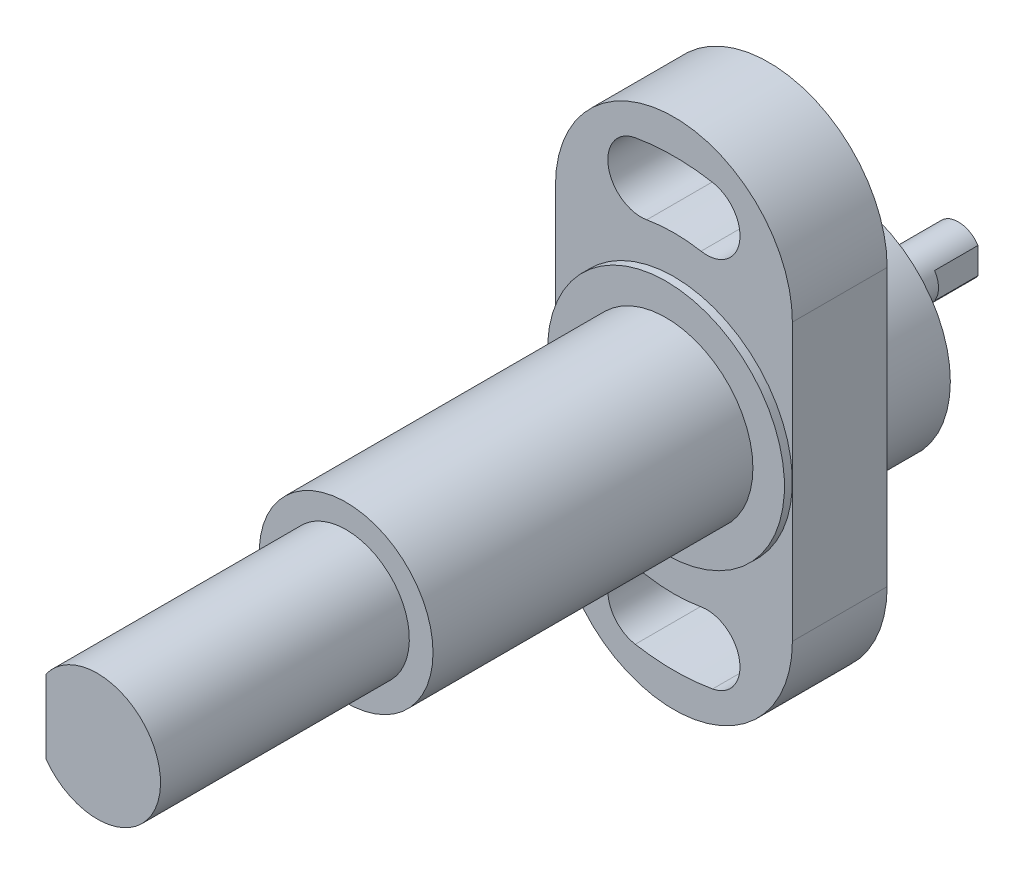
ISO-10303-21;
HEADER;
FILE_DESCRIPTION(('STEP AP214'),'2;1');
FILE_NAME('part.step','',(''),(''),'','','');
FILE_SCHEMA(('AUTOMOTIVE_DESIGN { 1 0 10303 214 1 1 1 1 }'));
ENDSEC;
DATA;
#1=APPLICATION_CONTEXT('core data for automotive mechanical design processes');
#2=APPLICATION_PROTOCOL_DEFINITION('international standard','automotive_design',2000,#1);
#3=PRODUCT_CONTEXT('',#1,'mechanical');
#4=PRODUCT('Part','Part','',(#3));
#5=PRODUCT_RELATED_PRODUCT_CATEGORY('part','',(#4));
#6=PRODUCT_DEFINITION_FORMATION('','',#4);
#7=PRODUCT_DEFINITION_CONTEXT('part definition',#1,'design');
#8=PRODUCT_DEFINITION('design','',#6,#7);
#9=PRODUCT_DEFINITION_SHAPE('','',#8);
#10=(LENGTH_UNIT() NAMED_UNIT(*) SI_UNIT(.MILLI.,.METRE.));
#11=(NAMED_UNIT(*) PLANE_ANGLE_UNIT() SI_UNIT($,.RADIAN.));
#12=(NAMED_UNIT(*) SI_UNIT($,.STERADIAN.) SOLID_ANGLE_UNIT());
#13=UNCERTAINTY_MEASURE_WITH_UNIT(LENGTH_MEASURE(1.E-05),#10,'distance_accuracy_value','');
#14=(GEOMETRIC_REPRESENTATION_CONTEXT(3) GLOBAL_UNCERTAINTY_ASSIGNED_CONTEXT((#13)) GLOBAL_UNIT_ASSIGNED_CONTEXT((#10,
#11,#12)) REPRESENTATION_CONTEXT('',''));
#15=CARTESIAN_POINT('',(0.,0.,0.));
#16=DIRECTION('',(0.,0.,1.));
#17=DIRECTION('',(1.,0.,0.));
#18=AXIS2_PLACEMENT_3D('',#15,#16,#17);
#19=CARTESIAN_POINT('',(-8.,0.,-9.));
#20=DIRECTION('',(0.,0.,-1.));
#21=DIRECTION('',(0.,1.,0.));
#22=AXIS2_PLACEMENT_3D('',#19,#20,#21);
#23=PLANE('',#22);
#24=CARTESIAN_POINT('',(0.,0.,-9.));
#25=DIRECTION('',(0.,0.,1.));
#26=DIRECTION('',(0.,1.,0.));
#27=AXIS2_PLACEMENT_3D('',#24,#25,#26);
#28=CIRCLE('',#27,14.);
#29=CARTESIAN_POINT('',(0.,14.,-9.));
#30=VERTEX_POINT('',#29);
#31=EDGE_CURVE('E291',#30,#30,#28,.T.);
#32=ORIENTED_EDGE('',*,*,#31,.F.);
#33=EDGE_LOOP('',(#32));
#34=FACE_BOUND('',#33,.T.);
#35=CARTESIAN_POINT('',(0.,0.,-9.));
#36=DIRECTION('',(0.,0.,-1.));
#37=DIRECTION('',(-1.,0.,0.));
#38=AXIS2_PLACEMENT_3D('',#35,#36,#37);
#39=CIRCLE('',#38,3.);
#40=CARTESIAN_POINT('',(-3.,0.,-9.));
#41=VERTEX_POINT('',#40);
#42=EDGE_CURVE('E195',#41,#41,#39,.T.);
#43=ORIENTED_EDGE('',*,*,#42,.F.);
#44=EDGE_LOOP('',(#43));
#45=FACE_BOUND('',#44,.T.);
#46=ADVANCED_FACE('F15',(#34,#45),#23,.T.);
#47=CARTESIAN_POINT('',(0.,0.,-9.));
#48=DIRECTION('',(0.,0.,1.));
#49=DIRECTION('',(0.,-1.,0.));
#50=AXIS2_PLACEMENT_3D('',#47,#48,#49);
#51=CYLINDRICAL_SURFACE('',#50,28.2);
#52=DIRECTION('',(0.,0.,1.));
#53=VECTOR('',#52,1.);
#54=CARTESIAN_POINT('',(4.89687861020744,27.7715786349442,-9.));
#55=LINE('',#54,#53);
#56=CARTESIAN_POINT('',(4.89687861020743,27.7715786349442,0.));
#57=VERTEX_POINT('',#56);
#58=CARTESIAN_POINT('',(4.89687861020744,27.7715786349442,12.));
#59=VERTEX_POINT('',#58);
#60=EDGE_CURVE('E287',#57,#59,#55,.T.);
#61=ORIENTED_EDGE('',*,*,#60,.T.);
#62=CARTESIAN_POINT('',(0.,0.,12.));
#63=DIRECTION('',(0.,0.,1.));
#64=DIRECTION('',(0.,1.,0.));
#65=AXIS2_PLACEMENT_3D('',#62,#63,#64);
#66=CIRCLE('',#65,28.2);
#67=CARTESIAN_POINT('',(-4.89687861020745,27.7715786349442,12.));
#68=VERTEX_POINT('',#67);
#69=EDGE_CURVE('E391',#59,#68,#66,.T.);
#70=ORIENTED_EDGE('',*,*,#69,.T.);
#71=DIRECTION('',(0.,0.,1.));
#72=VECTOR('',#71,1.);
#73=CARTESIAN_POINT('',(-4.89687861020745,27.7715786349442,-9.));
#74=LINE('',#73,#72);
#75=CARTESIAN_POINT('',(-4.89687861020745,27.7715786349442,0.));
#76=VERTEX_POINT('',#75);
#77=EDGE_CURVE('E292',#76,#68,#74,.T.);
#78=ORIENTED_EDGE('',*,*,#77,.F.);
#79=CARTESIAN_POINT('',(0.,0.,0.));
#80=DIRECTION('',(0.,0.,1.));
#81=DIRECTION('',(-1.,0.,0.));
#82=AXIS2_PLACEMENT_3D('',#79,#80,#81);
#83=CIRCLE('',#82,28.2);
#84=EDGE_CURVE('E224',#57,#76,#83,.T.);
#85=ORIENTED_EDGE('',*,*,#84,.F.);
#86=EDGE_LOOP('',(#61,#70,#78,#85));
#87=FACE_BOUND('',#86,.T.);
#88=ADVANCED_FACE('F457',(#87),#51,.F.);
#89=CARTESIAN_POINT('',(-4.16755626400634,23.635386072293,-9.));
#90=DIRECTION('',(0.,0.,1.));
#91=DIRECTION('',(0.,-1.,0.));
#92=AXIS2_PLACEMENT_3D('',#89,#90,#91);
#93=CYLINDRICAL_SURFACE('',#92,4.2);
#94=ORIENTED_EDGE('',*,*,#77,.T.);
#95=CARTESIAN_POINT('',(-4.16755626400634,23.635386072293,12.));
#96=DIRECTION('',(0.,0.,1.));
#97=DIRECTION('',(0.,1.,0.));
#98=AXIS2_PLACEMENT_3D('',#95,#96,#97);
#99=CIRCLE('',#98,4.2);
#100=CARTESIAN_POINT('',(-3.43823391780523,19.4991935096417,12.));
#101=VERTEX_POINT('',#100);
#102=EDGE_CURVE('E387',#68,#101,#99,.T.);
#103=ORIENTED_EDGE('',*,*,#102,.T.);
#104=DIRECTION('',(0.,0.,1.));
#105=VECTOR('',#104,1.);
#106=CARTESIAN_POINT('',(-3.43823391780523,19.4991935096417,-9.));
#107=LINE('',#106,#105);
#108=CARTESIAN_POINT('',(-3.43823391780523,19.4991935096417,0.));
#109=VERTEX_POINT('',#108);
#110=EDGE_CURVE('E296',#109,#101,#107,.T.);
#111=ORIENTED_EDGE('',*,*,#110,.F.);
#112=CARTESIAN_POINT('',(-4.16755626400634,23.635386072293,0.));
#113=DIRECTION('',(0.,0.,1.));
#114=DIRECTION('',(-1.,0.,0.));
#115=AXIS2_PLACEMENT_3D('',#112,#113,#114);
#116=CIRCLE('',#115,4.2);
#117=EDGE_CURVE('E228',#76,#109,#116,.T.);
#118=ORIENTED_EDGE('',*,*,#117,.F.);
#119=EDGE_LOOP('',(#94,#103,#111,#118));
#120=FACE_BOUND('',#119,.T.);
#121=ADVANCED_FACE('F464',(#120),#93,.F.);
#122=CARTESIAN_POINT('',(0.,0.,-9.));
#123=DIRECTION('',(0.,0.,1.));
#124=DIRECTION('',(0.,-1.,0.));
#125=AXIS2_PLACEMENT_3D('',#122,#123,#124);
#126=CYLINDRICAL_SURFACE('',#125,19.8);
#127=ORIENTED_EDGE('',*,*,#110,.T.);
#128=CARTESIAN_POINT('',(0.,0.,12.));
#129=DIRECTION('',(0.,0.,1.));
#130=DIRECTION('',(0.,1.,0.));
#131=AXIS2_PLACEMENT_3D('',#128,#129,#130);
#132=CIRCLE('',#131,19.8);
#133=CARTESIAN_POINT('',(3.43823391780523,19.4991935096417,12.));
#134=VERTEX_POINT('',#133);
#135=EDGE_CURVE('E383',#101,#134,#132,.F.);
#136=ORIENTED_EDGE('',*,*,#135,.T.);
#137=DIRECTION('',(0.,0.,1.));
#138=VECTOR('',#137,1.);
#139=CARTESIAN_POINT('',(3.43823391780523,19.4991935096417,-9.));
#140=LINE('',#139,#138);
#141=CARTESIAN_POINT('',(3.43823391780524,19.4991935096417,0.));
#142=VERTEX_POINT('',#141);
#143=EDGE_CURVE('E275',#142,#134,#140,.T.);
#144=ORIENTED_EDGE('',*,*,#143,.F.);
#145=CARTESIAN_POINT('',(0.,0.,0.));
#146=DIRECTION('',(0.,0.,-1.));
#147=DIRECTION('',(-1.,0.,0.));
#148=AXIS2_PLACEMENT_3D('',#145,#146,#147);
#149=CIRCLE('',#148,19.8);
#150=EDGE_CURVE('E232',#109,#142,#149,.T.);
#151=ORIENTED_EDGE('',*,*,#150,.F.);
#152=EDGE_LOOP('',(#127,#136,#144,#151));
#153=FACE_BOUND('',#152,.T.);
#154=ADVANCED_FACE('F619',(#153),#126,.T.);
#155=CARTESIAN_POINT('',(4.16755626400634,23.635386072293,-9.));
#156=DIRECTION('',(0.,0.,1.));
#157=DIRECTION('',(0.,-1.,0.));
#158=AXIS2_PLACEMENT_3D('',#155,#156,#157);
#159=CYLINDRICAL_SURFACE('',#158,4.2);
#160=ORIENTED_EDGE('',*,*,#143,.T.);
#161=CARTESIAN_POINT('',(4.16755626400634,23.635386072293,12.));
#162=DIRECTION('',(0.,0.,1.));
#163=DIRECTION('',(0.,1.,0.));
#164=AXIS2_PLACEMENT_3D('',#161,#162,#163);
#165=CIRCLE('',#164,4.2);
#166=EDGE_CURVE('E395',#134,#59,#165,.T.);
#167=ORIENTED_EDGE('',*,*,#166,.T.);
#168=ORIENTED_EDGE('',*,*,#60,.F.);
#169=CARTESIAN_POINT('',(4.16755626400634,23.635386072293,0.));
#170=DIRECTION('',(0.,0.,1.));
#171=DIRECTION('',(-1.,0.,0.));
#172=AXIS2_PLACEMENT_3D('',#169,#170,#171);
#173=CIRCLE('',#172,4.2);
#174=EDGE_CURVE('E221',#142,#57,#173,.T.);
#175=ORIENTED_EDGE('',*,*,#174,.F.);
#176=EDGE_LOOP('',(#160,#167,#168,#175));
#177=FACE_BOUND('',#176,.T.);
#178=ADVANCED_FACE('F605',(#177),#159,.F.);
#179=CARTESIAN_POINT('',(0.,0.,-9.));
#180=DIRECTION('',(0.,0.,1.));
#181=DIRECTION('',(0.,-1.,0.));
#182=AXIS2_PLACEMENT_3D('',#179,#180,#181);
#183=CYLINDRICAL_SURFACE('',#182,28.2);
#184=DIRECTION('',(0.,0.,1.));
#185=VECTOR('',#184,1.);
#186=CARTESIAN_POINT('',(-4.89687861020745,-27.7715786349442,-9.));
#187=LINE('',#186,#185);
#188=CARTESIAN_POINT('',(-4.89687861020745,-27.7715786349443,0.));
#189=VERTEX_POINT('',#188);
#190=CARTESIAN_POINT('',(-4.89687861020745,-27.7715786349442,12.));
#191=VERTEX_POINT('',#190);
#192=EDGE_CURVE('E271',#189,#191,#187,.T.);
#193=ORIENTED_EDGE('',*,*,#192,.T.);
#194=CARTESIAN_POINT('',(0.,0.,12.));
#195=DIRECTION('',(0.,0.,1.));
#196=DIRECTION('',(0.,1.,0.));
#197=AXIS2_PLACEMENT_3D('',#194,#195,#196);
#198=CIRCLE('',#197,28.2);
#199=CARTESIAN_POINT('',(4.89687861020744,-27.7715786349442,12.));
#200=VERTEX_POINT('',#199);
#201=EDGE_CURVE('E25',#191,#200,#198,.T.);
#202=ORIENTED_EDGE('',*,*,#201,.T.);
#203=DIRECTION('',(0.,0.,1.));
#204=VECTOR('',#203,1.);
#205=CARTESIAN_POINT('',(4.89687861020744,-27.7715786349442,-9.));
#206=LINE('',#205,#204);
#207=CARTESIAN_POINT('',(4.89687861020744,-27.7715786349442,0.));
#208=VERTEX_POINT('',#207);
#209=EDGE_CURVE('E276',#208,#200,#206,.T.);
#210=ORIENTED_EDGE('',*,*,#209,.F.);
#211=CARTESIAN_POINT('',(0.,0.,0.));
#212=DIRECTION('',(0.,0.,1.));
#213=DIRECTION('',(-1.,0.,0.));
#214=AXIS2_PLACEMENT_3D('',#211,#212,#213);
#215=CIRCLE('',#214,28.2);
#216=EDGE_CURVE('E213',#189,#208,#215,.T.);
#217=ORIENTED_EDGE('',*,*,#216,.F.);
#218=EDGE_LOOP('',(#193,#202,#210,#217));
#219=FACE_BOUND('',#218,.T.);
#220=ADVANCED_FACE('F601',(#219),#183,.F.);
#221=CARTESIAN_POINT('',(4.16755626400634,-23.635386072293,-9.));
#222=DIRECTION('',(0.,0.,1.));
#223=DIRECTION('',(0.,-1.,0.));
#224=AXIS2_PLACEMENT_3D('',#221,#222,#223);
#225=CYLINDRICAL_SURFACE('',#224,4.2);
#226=ORIENTED_EDGE('',*,*,#209,.T.);
#227=CARTESIAN_POINT('',(4.16755626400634,-23.635386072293,12.));
#228=DIRECTION('',(0.,0.,1.));
#229=DIRECTION('',(0.,1.,0.));
#230=AXIS2_PLACEMENT_3D('',#227,#228,#229);
#231=CIRCLE('',#230,4.2);
#232=CARTESIAN_POINT('',(3.43823391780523,-19.4991935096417,12.));
#233=VERTEX_POINT('',#232);
#234=EDGE_CURVE('E402',#200,#233,#231,.T.);
#235=ORIENTED_EDGE('',*,*,#234,.T.);
#236=DIRECTION('',(0.,0.,1.));
#237=VECTOR('',#236,1.);
#238=CARTESIAN_POINT('',(3.43823391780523,-19.4991935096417,-9.));
#239=LINE('',#238,#237);
#240=CARTESIAN_POINT('',(3.43823391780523,-19.4991935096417,0.));
#241=VERTEX_POINT('',#240);
#242=EDGE_CURVE('E280',#241,#233,#239,.T.);
#243=ORIENTED_EDGE('',*,*,#242,.F.);
#244=CARTESIAN_POINT('',(4.16755626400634,-23.635386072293,0.));
#245=DIRECTION('',(0.,0.,1.));
#246=DIRECTION('',(-1.,0.,0.));
#247=AXIS2_PLACEMENT_3D('',#244,#245,#246);
#248=CIRCLE('',#247,4.2);
#249=EDGE_CURVE('E217',#208,#241,#248,.T.);
#250=ORIENTED_EDGE('',*,*,#249,.F.);
#251=EDGE_LOOP('',(#226,#235,#243,#250));
#252=FACE_BOUND('',#251,.T.);
#253=ADVANCED_FACE('F604',(#252),#225,.F.);
#254=CARTESIAN_POINT('',(0.,0.,-9.));
#255=DIRECTION('',(0.,0.,1.));
#256=DIRECTION('',(0.,-1.,0.));
#257=AXIS2_PLACEMENT_3D('',#254,#255,#256);
#258=CYLINDRICAL_SURFACE('',#257,19.8);
#259=ORIENTED_EDGE('',*,*,#242,.T.);
#260=CARTESIAN_POINT('',(0.,0.,12.));
#261=DIRECTION('',(0.,0.,1.));
#262=DIRECTION('',(0.,1.,0.));
#263=AXIS2_PLACEMENT_3D('',#260,#261,#262);
#264=CIRCLE('',#263,19.8);
#265=CARTESIAN_POINT('',(-3.43823391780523,-19.4991935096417,12.));
#266=VERTEX_POINT('',#265);
#267=EDGE_CURVE('E398',#233,#266,#264,.F.);
#268=ORIENTED_EDGE('',*,*,#267,.T.);
#269=DIRECTION('',(0.,0.,1.));
#270=VECTOR('',#269,1.);
#271=CARTESIAN_POINT('',(-3.43823391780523,-19.4991935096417,-9.));
#272=LINE('',#271,#270);
#273=CARTESIAN_POINT('',(-3.43823391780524,-19.4991935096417,0.));
#274=VERTEX_POINT('',#273);
#275=EDGE_CURVE('E270',#274,#266,#272,.T.);
#276=ORIENTED_EDGE('',*,*,#275,.F.);
#277=CARTESIAN_POINT('',(0.,0.,0.));
#278=DIRECTION('',(0.,0.,-1.));
#279=DIRECTION('',(-1.,0.,0.));
#280=AXIS2_PLACEMENT_3D('',#277,#278,#279);
#281=CIRCLE('',#280,19.8);
#282=EDGE_CURVE('E203',#241,#274,#281,.T.);
#283=ORIENTED_EDGE('',*,*,#282,.F.);
#284=EDGE_LOOP('',(#259,#268,#276,#283));
#285=FACE_BOUND('',#284,.T.);
#286=ADVANCED_FACE('F609',(#285),#258,.T.);
#287=CARTESIAN_POINT('',(-4.16755626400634,-23.635386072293,-9.));
#288=DIRECTION('',(0.,0.,1.));
#289=DIRECTION('',(0.,-1.,0.));
#290=AXIS2_PLACEMENT_3D('',#287,#288,#289);
#291=CYLINDRICAL_SURFACE('',#290,4.2);
#292=ORIENTED_EDGE('',*,*,#275,.T.);
#293=CARTESIAN_POINT('',(-4.16755626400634,-23.635386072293,12.));
#294=DIRECTION('',(0.,0.,1.));
#295=DIRECTION('',(0.,1.,0.));
#296=AXIS2_PLACEMENT_3D('',#293,#294,#295);
#297=CIRCLE('',#296,4.2);
#298=EDGE_CURVE('E9',#266,#191,#297,.T.);
#299=ORIENTED_EDGE('',*,*,#298,.T.);
#300=ORIENTED_EDGE('',*,*,#192,.F.);
#301=CARTESIAN_POINT('',(-4.16755626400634,-23.635386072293,0.));
#302=DIRECTION('',(0.,0.,1.));
#303=DIRECTION('',(-1.,0.,0.));
#304=AXIS2_PLACEMENT_3D('',#301,#302,#303);
#305=CIRCLE('',#304,4.2);
#306=EDGE_CURVE('E210',#274,#189,#305,.T.);
#307=ORIENTED_EDGE('',*,*,#306,.F.);
#308=EDGE_LOOP('',(#292,#299,#300,#307));
#309=FACE_BOUND('',#308,.T.);
#310=ADVANCED_FACE('F533',(#309),#291,.F.);
#311=CARTESIAN_POINT('',(-11.,0.,13.));
#312=DIRECTION('',(0.,0.,1.));
#313=DIRECTION('',(0.,-1.,0.));
#314=AXIS2_PLACEMENT_3D('',#311,#312,#313);
#315=PLANE('',#314);
#316=CARTESIAN_POINT('',(0.,0.,13.));
#317=DIRECTION('',(0.,0.,-1.));
#318=DIRECTION('',(0.,-1.,0.));
#319=AXIS2_PLACEMENT_3D('',#316,#317,#318);
#320=CIRCLE('',#319,11.);
#321=CARTESIAN_POINT('',(0.,-11.,13.));
#322=VERTEX_POINT('',#321);
#323=EDGE_CURVE('E365',#322,#322,#320,.F.);
#324=ORIENTED_EDGE('',*,*,#323,.F.);
#325=EDGE_LOOP('',(#324));
#326=FACE_BOUND('',#325,.T.);
#327=CARTESIAN_POINT('',(0.,0.,13.));
#328=DIRECTION('',(0.,0.,1.));
#329=DIRECTION('',(0.,1.,0.));
#330=AXIS2_PLACEMENT_3D('',#327,#328,#329);
#331=CIRCLE('',#330,14.995);
#332=CARTESIAN_POINT('',(0.,14.995,13.));
#333=VERTEX_POINT('',#332);
#334=EDGE_CURVE('E361',#333,#333,#331,.T.);
#335=ORIENTED_EDGE('',*,*,#334,.T.);
#336=EDGE_LOOP('',(#335));
#337=FACE_BOUND('',#336,.T.);
#338=ADVANCED_FACE('F530',(#326,#337),#315,.T.);
#339=CARTESIAN_POINT('',(-15.,-10.,6.));
#340=DIRECTION('',(-1.,0.,0.));
#341=DIRECTION('',(0.,1.,0.));
#342=AXIS2_PLACEMENT_3D('',#339,#340,#341);
#343=CONICAL_SURFACE('',#342,2.65,0.78539816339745);
#344=CARTESIAN_POINT('',(-14.85,-10.,6.));
#345=DIRECTION('',(-1.,0.,0.));
#346=DIRECTION('',(0.,0.,1.));
#347=AXIS2_PLACEMENT_3D('',#344,#345,#346);
#348=CIRCLE('',#347,2.5);
#349=CARTESIAN_POINT('',(-14.85,-10.,8.5));
#350=VERTEX_POINT('',#349);
#351=EDGE_CURVE('E420',#350,#350,#348,.F.);
#352=ORIENTED_EDGE('',*,*,#351,.T.);
#353=EDGE_LOOP('',(#352));
#354=FACE_BOUND('',#353,.T.);
#355=CARTESIAN_POINT('',(-15.,-10.,6.));
#356=DIRECTION('',(1.,0.,0.));
#357=DIRECTION('',(0.,1.,0.));
#358=AXIS2_PLACEMENT_3D('',#355,#356,#357);
#359=CIRCLE('',#358,2.65);
#360=CARTESIAN_POINT('',(-15.,-7.35,6.));
#361=VERTEX_POINT('',#360);
#362=EDGE_CURVE('E257',#361,#361,#359,.T.);
#363=ORIENTED_EDGE('',*,*,#362,.F.);
#364=EDGE_LOOP('',(#363));
#365=FACE_BOUND('',#364,.T.);
#366=ADVANCED_FACE('F528',(#354,#365),#343,.F.);
#367=CARTESIAN_POINT('',(0.,0.,0.));
#368=DIRECTION('',(0.,0.,-1.));
#369=DIRECTION('',(0.,1.,0.));
#370=AXIS2_PLACEMENT_3D('',#367,#368,#369);
#371=CYLINDRICAL_SURFACE('',#370,14.995);
#372=ORIENTED_EDGE('',*,*,#334,.F.);
#373=EDGE_LOOP('',(#372));
#374=FACE_BOUND('',#373,.T.);
#375=CARTESIAN_POINT('',(0.,0.,12.));
#376=DIRECTION('',(0.,0.,-1.));
#377=DIRECTION('',(0.,-1.,0.));
#378=AXIS2_PLACEMENT_3D('',#375,#376,#377);
#379=CIRCLE('',#378,14.995);
#380=CARTESIAN_POINT('',(0.,-14.995,12.));
#381=VERTEX_POINT('',#380);
#382=EDGE_CURVE('E326',#381,#381,#379,.T.);
#383=ORIENTED_EDGE('',*,*,#382,.F.);
#384=EDGE_LOOP('',(#383));
#385=FACE_BOUND('',#384,.T.);
#386=ADVANCED_FACE('F514',(#374,#385),#371,.T.);
#387=CARTESIAN_POINT('',(15.,17.5,12.));
#388=DIRECTION('',(-1.,0.,0.));
#389=DIRECTION('',(0.,1.,0.));
#390=AXIS2_PLACEMENT_3D('',#387,#388,#389);
#391=PLANE('',#390);
#392=DIRECTION('',(0.,1.,0.));
#393=VECTOR('',#392,1.);
#394=CARTESIAN_POINT('',(15.,-17.5,0.));
#395=LINE('',#394,#393);
#396=CARTESIAN_POINT('',(15.,-17.5,0.));
#397=VERTEX_POINT('',#396);
#398=CARTESIAN_POINT('',(15.,17.5,0.));
#399=VERTEX_POINT('',#398);
#400=EDGE_CURVE('E243',#397,#399,#395,.T.);
#401=ORIENTED_EDGE('',*,*,#400,.T.);
#402=DIRECTION('',(0.,0.,-1.));
#403=VECTOR('',#402,1.);
#404=CARTESIAN_POINT('',(15.,17.5,12.));
#405=LINE('',#404,#403);
#406=CARTESIAN_POINT('',(15.,17.5,12.));
#407=VERTEX_POINT('',#406);
#408=EDGE_CURVE('E349',#407,#399,#405,.T.);
#409=ORIENTED_EDGE('',*,*,#408,.F.);
#410=DIRECTION('',(0.,-1.,0.));
#411=VECTOR('',#410,1.);
#412=CARTESIAN_POINT('',(15.,17.5,12.));
#413=LINE('',#412,#411);
#414=CARTESIAN_POINT('',(15.,-17.5,12.));
#415=VERTEX_POINT('',#414);
#416=EDGE_CURVE('E341',#407,#415,#413,.T.);
#417=ORIENTED_EDGE('',*,*,#416,.T.);
#418=DIRECTION('',(0.,0.,-1.));
#419=VECTOR('',#418,1.);
#420=CARTESIAN_POINT('',(15.,-17.5,12.));
#421=LINE('',#420,#419);
#422=EDGE_CURVE('E345',#415,#397,#421,.T.);
#423=ORIENTED_EDGE('',*,*,#422,.T.);
#424=EDGE_LOOP('',(#401,#409,#417,#423));
#425=FACE_BOUND('',#424,.T.);
#426=ADVANCED_FACE('F510',(#425),#391,.F.);
#427=CARTESIAN_POINT('',(0.,-17.5,12.));
#428=DIRECTION('',(0.,0.,-1.));
#429=DIRECTION('',(0.,1.,0.));
#430=AXIS2_PLACEMENT_3D('',#427,#428,#429);
#431=CYLINDRICAL_SURFACE('',#430,15.);
#432=CARTESIAN_POINT('',(0.,-17.5,0.));
#433=DIRECTION('',(0.,0.,1.));
#434=DIRECTION('',(-1.,0.,0.));
#435=AXIS2_PLACEMENT_3D('',#432,#433,#434);
#436=CIRCLE('',#435,15.);
#437=CARTESIAN_POINT('',(-15.,-17.5,0.));
#438=VERTEX_POINT('',#437);
#439=EDGE_CURVE('E240',#438,#397,#436,.T.);
#440=ORIENTED_EDGE('',*,*,#439,.T.);
#441=ORIENTED_EDGE('',*,*,#422,.F.);
#442=CARTESIAN_POINT('',(0.,-17.5,12.));
#443=DIRECTION('',(0.,0.,-1.));
#444=DIRECTION('',(0.,1.,0.));
#445=AXIS2_PLACEMENT_3D('',#442,#443,#444);
#446=CIRCLE('',#445,15.);
#447=CARTESIAN_POINT('',(-15.,-17.5,12.));
#448=VERTEX_POINT('',#447);
#449=EDGE_CURVE('E330',#415,#448,#446,.T.);
#450=ORIENTED_EDGE('',*,*,#449,.T.);
#451=DIRECTION('',(0.,0.,-1.));
#452=VECTOR('',#451,1.);
#453=CARTESIAN_POINT('',(-15.,-17.5,12.));
#454=LINE('',#453,#452);
#455=EDGE_CURVE('E357',#448,#438,#454,.T.);
#456=ORIENTED_EDGE('',*,*,#455,.T.);
#457=EDGE_LOOP('',(#440,#441,#450,#456));
#458=FACE_BOUND('',#457,.T.);
#459=ADVANCED_FACE('F513',(#458),#431,.T.);
#460=CARTESIAN_POINT('',(-15.,17.5,12.));
#461=DIRECTION('',(1.,0.,0.));
#462=DIRECTION('',(0.,-1.,0.));
#463=AXIS2_PLACEMENT_3D('',#460,#461,#462);
#464=PLANE('',#463);
#465=DIRECTION('',(0.,-1.,0.));
#466=VECTOR('',#465,1.);
#467=CARTESIAN_POINT('',(-15.,17.5,0.));
#468=LINE('',#467,#466);
#469=CARTESIAN_POINT('',(-15.,17.5,0.));
#470=VERTEX_POINT('',#469);
#471=EDGE_CURVE('E250',#470,#438,#468,.T.);
#472=ORIENTED_EDGE('',*,*,#471,.T.);
#473=ORIENTED_EDGE('',*,*,#455,.F.);
#474=DIRECTION('',(0.,1.,0.));
#475=VECTOR('',#474,1.);
#476=CARTESIAN_POINT('',(-15.,17.5,12.));
#477=LINE('',#476,#475);
#478=CARTESIAN_POINT('',(-15.,17.5,12.));
#479=VERTEX_POINT('',#478);
#480=EDGE_CURVE('E334',#448,#479,#477,.T.);
#481=ORIENTED_EDGE('',*,*,#480,.T.);
#482=DIRECTION('',(0.,0.,-1.));
#483=VECTOR('',#482,1.);
#484=CARTESIAN_POINT('',(-15.,17.5,12.));
#485=LINE('',#484,#483);
#486=EDGE_CURVE('E353',#479,#470,#485,.T.);
#487=ORIENTED_EDGE('',*,*,#486,.T.);
#488=EDGE_LOOP('',(#472,#473,#481,#487));
#489=FACE_BOUND('',#488,.T.);
#490=ORIENTED_EDGE('',*,*,#362,.T.);
#491=EDGE_LOOP('',(#490));
#492=FACE_BOUND('',#491,.T.);
#493=ADVANCED_FACE('F518',(#489,#492),#464,.F.);
#494=CARTESIAN_POINT('',(0.,17.5,12.));
#495=DIRECTION('',(0.,0.,-1.));
#496=DIRECTION('',(0.,1.,0.));
#497=AXIS2_PLACEMENT_3D('',#494,#495,#496);
#498=CYLINDRICAL_SURFACE('',#497,15.);
#499=CARTESIAN_POINT('',(0.,17.5,0.));
#500=DIRECTION('',(0.,0.,1.));
#501=DIRECTION('',(-1.,0.,0.));
#502=AXIS2_PLACEMENT_3D('',#499,#500,#501);
#503=CIRCLE('',#502,15.);
#504=EDGE_CURVE('E247',#399,#470,#503,.T.);
#505=ORIENTED_EDGE('',*,*,#504,.T.);
#506=ORIENTED_EDGE('',*,*,#486,.F.);
#507=CARTESIAN_POINT('',(0.,17.5,12.));
#508=DIRECTION('',(0.,0.,-1.));
#509=DIRECTION('',(0.,-1.,0.));
#510=AXIS2_PLACEMENT_3D('',#507,#508,#509);
#511=CIRCLE('',#510,15.);
#512=EDGE_CURVE('E338',#479,#407,#511,.T.);
#513=ORIENTED_EDGE('',*,*,#512,.T.);
#514=ORIENTED_EDGE('',*,*,#408,.T.);
#515=EDGE_LOOP('',(#505,#506,#513,#514));
#516=FACE_BOUND('',#515,.T.);
#517=ADVANCED_FACE('F508',(#516),#498,.T.);
#518=CARTESIAN_POINT('',(0.,-17.5,12.));
#519=DIRECTION('',(0.,0.,-1.));
#520=DIRECTION('',(0.,1.,0.));
#521=AXIS2_PLACEMENT_3D('',#518,#519,#520);
#522=PLANE('',#521);
#523=ORIENTED_EDGE('',*,*,#267,.F.);
#524=ORIENTED_EDGE('',*,*,#234,.F.);
#525=ORIENTED_EDGE('',*,*,#201,.F.);
#526=ORIENTED_EDGE('',*,*,#298,.F.);
#527=EDGE_LOOP('',(#523,#524,#525,#526));
#528=FACE_BOUND('',#527,.T.);
#529=ORIENTED_EDGE('',*,*,#135,.F.);
#530=ORIENTED_EDGE('',*,*,#102,.F.);
#531=ORIENTED_EDGE('',*,*,#69,.F.);
#532=ORIENTED_EDGE('',*,*,#166,.F.);
#533=EDGE_LOOP('',(#529,#530,#531,#532));
#534=FACE_BOUND('',#533,.T.);
#535=ORIENTED_EDGE('',*,*,#449,.F.);
#536=ORIENTED_EDGE('',*,*,#416,.F.);
#537=ORIENTED_EDGE('',*,*,#512,.F.);
#538=ORIENTED_EDGE('',*,*,#480,.F.);
#539=EDGE_LOOP('',(#535,#536,#537,#538));
#540=FACE_BOUND('',#539,.T.);
#541=ORIENTED_EDGE('',*,*,#382,.T.);
#542=EDGE_LOOP('',(#541));
#543=FACE_BOUND('',#542,.T.);
#544=ADVANCED_FACE('F505',(#528,#534,#540,#543),#522,.F.);
#545=CARTESIAN_POINT('',(0.,0.,0.));
#546=DIRECTION('',(0.,0.,-1.));
#547=DIRECTION('',(0.,1.,0.));
#548=AXIS2_PLACEMENT_3D('',#545,#546,#547);
#549=CYLINDRICAL_SURFACE('',#548,14.);
#550=CARTESIAN_POINT('',(0.,0.,0.));
#551=DIRECTION('',(0.,0.,1.));
#552=DIRECTION('',(0.,1.,0.));
#553=AXIS2_PLACEMENT_3D('',#550,#551,#552);
#554=CIRCLE('',#553,14.);
#555=CARTESIAN_POINT('',(0.,14.,0.));
#556=VERTEX_POINT('',#555);
#557=EDGE_CURVE('E379',#556,#556,#554,.T.);
#558=ORIENTED_EDGE('',*,*,#557,.F.);
#559=EDGE_LOOP('',(#558));
#560=FACE_BOUND('',#559,.T.);
#561=ORIENTED_EDGE('',*,*,#31,.T.);
#562=EDGE_LOOP('',(#561));
#563=FACE_BOUND('',#562,.T.);
#564=ADVANCED_FACE('F471',(#560,#563),#549,.T.);
#565=CARTESIAN_POINT('',(-8.,0.,0.));
#566=DIRECTION('',(0.,0.,-1.));
#567=DIRECTION('',(0.,1.,0.));
#568=AXIS2_PLACEMENT_3D('',#565,#566,#567);
#569=PLANE('',#568);
#570=ORIENTED_EDGE('',*,*,#282,.T.);
#571=ORIENTED_EDGE('',*,*,#306,.T.);
#572=ORIENTED_EDGE('',*,*,#216,.T.);
#573=ORIENTED_EDGE('',*,*,#249,.T.);
#574=EDGE_LOOP('',(#570,#571,#572,#573));
#575=FACE_BOUND('',#574,.T.);
#576=ORIENTED_EDGE('',*,*,#174,.T.);
#577=ORIENTED_EDGE('',*,*,#84,.T.);
#578=ORIENTED_EDGE('',*,*,#117,.T.);
#579=ORIENTED_EDGE('',*,*,#150,.T.);
#580=EDGE_LOOP('',(#576,#577,#578,#579));
#581=FACE_BOUND('',#580,.T.);
#582=ORIENTED_EDGE('',*,*,#557,.T.);
#583=EDGE_LOOP('',(#582));
#584=FACE_BOUND('',#583,.T.);
#585=ORIENTED_EDGE('',*,*,#439,.F.);
#586=ORIENTED_EDGE('',*,*,#471,.F.);
#587=ORIENTED_EDGE('',*,*,#504,.F.);
#588=ORIENTED_EDGE('',*,*,#400,.F.);
#589=EDGE_LOOP('',(#585,#586,#587,#588));
#590=FACE_BOUND('',#589,.T.);
#591=ADVANCED_FACE('F17',(#575,#581,#584,#590),#569,.T.);
#592=CARTESIAN_POINT('',(0.,0.,0.));
#593=DIRECTION('',(0.,0.,-1.));
#594=DIRECTION('',(0.,1.,0.));
#595=AXIS2_PLACEMENT_3D('',#592,#593,#594);
#596=CYLINDRICAL_SURFACE('',#595,11.);
#597=ORIENTED_EDGE('',*,*,#323,.T.);
#598=EDGE_LOOP('',(#597));
#599=FACE_BOUND('',#598,.T.);
#600=CARTESIAN_POINT('',(0.,0.,53.5));
#601=DIRECTION('',(0.,0.,-1.));
#602=DIRECTION('',(1.,0.,0.));
#603=AXIS2_PLACEMENT_3D('',#600,#601,#602);
#604=CIRCLE('',#603,11.);
#605=CARTESIAN_POINT('',(11.,0.,53.5));
#606=VERTEX_POINT('',#605);
#607=EDGE_CURVE('E253',#606,#606,#604,.T.);
#608=ORIENTED_EDGE('',*,*,#607,.T.);
#609=EDGE_LOOP('',(#608));
#610=FACE_BOUND('',#609,.T.);
#611=ADVANCED_FACE('F477',(#599,#610),#596,.T.);
#612=CARTESIAN_POINT('',(-6.5,0.,81.));
#613=DIRECTION('',(-1.,0.,0.));
#614=DIRECTION('',(0.,1.,0.));
#615=AXIS2_PLACEMENT_3D('',#612,#613,#614);
#616=CONICAL_SURFACE('',#615,2.65,0.785398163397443);
#617=CARTESIAN_POINT('',(-6.35,0.,81.));
#618=DIRECTION('',(-1.,0.,0.));
#619=DIRECTION('',(0.,0.,1.));
#620=AXIS2_PLACEMENT_3D('',#617,#618,#619);
#621=CIRCLE('',#620,2.5);
#622=CARTESIAN_POINT('',(-6.35,0.,83.5));
#623=VERTEX_POINT('',#622);
#624=EDGE_CURVE('E412',#623,#623,#621,.F.);
#625=ORIENTED_EDGE('',*,*,#624,.T.);
#626=EDGE_LOOP('',(#625));
#627=FACE_BOUND('',#626,.T.);
#628=CARTESIAN_POINT('',(-6.5,0.,81.));
#629=DIRECTION('',(1.,0.,0.));
#630=DIRECTION('',(0.,1.,0.));
#631=AXIS2_PLACEMENT_3D('',#628,#629,#630);
#632=CIRCLE('',#631,2.65);
#633=CARTESIAN_POINT('',(-6.5,2.65,81.));
#634=VERTEX_POINT('',#633);
#635=EDGE_CURVE('E306',#634,#634,#632,.T.);
#636=ORIENTED_EDGE('',*,*,#635,.F.);
#637=EDGE_LOOP('',(#636));
#638=FACE_BOUND('',#637,.T.);
#639=ADVANCED_FACE('F473',(#627,#638),#616,.F.);
#640=CARTESIAN_POINT('',(-6.5,10.,75.));
#641=DIRECTION('',(0.500000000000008,0.,-0.866025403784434));
#642=DIRECTION('',(-0.866025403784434,0.,-0.500000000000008));
#643=AXIS2_PLACEMENT_3D('',#640,#641,#642);
#644=PLANE('',#643);
#645=CARTESIAN_POINT('',(0.,0.,78.7527767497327));
#646=DIRECTION('',(-0.500000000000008,0.,0.866025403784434));
#647=DIRECTION('',(-0.866025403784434,0.,-0.500000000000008));
#648=AXIS2_PLACEMENT_3D('',#645,#646,#647);
#649=ELLIPSE('',#648,9.23760430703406,8.);
#650=CARTESIAN_POINT('',(-6.5,4.66368952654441,75.));
#651=VERTEX_POINT('',#650);
#652=CARTESIAN_POINT('',(-6.5,-4.6636895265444,75.));
#653=VERTEX_POINT('',#652);
#654=EDGE_CURVE('E369',#651,#653,#649,.T.);
#655=ORIENTED_EDGE('',*,*,#654,.T.);
#656=DIRECTION('',(0.,-1.,0.));
#657=VECTOR('',#656,1.);
#658=CARTESIAN_POINT('',(-6.5,10.,75.));
#659=LINE('',#658,#657);
#660=EDGE_CURVE('E314',#651,#653,#659,.T.);
#661=ORIENTED_EDGE('',*,*,#660,.F.);
#662=EDGE_LOOP('',(#655,#661));
#663=FACE_BOUND('',#662,.T.);
#664=ADVANCED_FACE('F476',(#663),#644,.F.);
#665=CARTESIAN_POINT('',(0.,0.,85.));
#666=DIRECTION('',(0.,0.,1.));
#667=DIRECTION('',(0.,-1.,0.));
#668=AXIS2_PLACEMENT_3D('',#665,#666,#667);
#669=PLANE('',#668);
#670=DIRECTION('',(0.,-1.,0.));
#671=VECTOR('',#670,1.);
#672=CARTESIAN_POINT('',(-6.5,10.,85.));
#673=LINE('',#672,#671);
#674=CARTESIAN_POINT('',(-6.5,4.6636895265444,85.));
#675=VERTEX_POINT('',#674);
#676=CARTESIAN_POINT('',(-6.5,-4.6636895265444,85.));
#677=VERTEX_POINT('',#676);
#678=EDGE_CURVE('E315',#675,#677,#673,.T.);
#679=ORIENTED_EDGE('',*,*,#678,.T.);
#680=CARTESIAN_POINT('',(0.,0.,85.));
#681=DIRECTION('',(0.,0.,-1.));
#682=DIRECTION('',(1.,0.,0.));
#683=AXIS2_PLACEMENT_3D('',#680,#681,#682);
#684=CIRCLE('',#683,8.);
#685=EDGE_CURVE('E236',#675,#677,#684,.T.);
#686=ORIENTED_EDGE('',*,*,#685,.F.);
#687=EDGE_LOOP('',(#679,#686));
#688=FACE_BOUND('',#687,.T.);
#689=ADVANCED_FACE('F491',(#688),#669,.T.);
#690=CARTESIAN_POINT('',(-6.5,10.,85.));
#691=DIRECTION('',(1.,0.,0.));
#692=DIRECTION('',(0.,0.,-1.));
#693=AXIS2_PLACEMENT_3D('',#690,#691,#692);
#694=PLANE('',#693);
#695=ORIENTED_EDGE('',*,*,#678,.F.);
#696=DIRECTION('',(0.,0.,-1.));
#697=VECTOR('',#696,1.);
#698=CARTESIAN_POINT('',(-6.5,4.6636895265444,0.));
#699=LINE('',#698,#697);
#700=EDGE_CURVE('E376',#675,#651,#699,.T.);
#701=ORIENTED_EDGE('',*,*,#700,.T.);
#702=ORIENTED_EDGE('',*,*,#660,.T.);
#703=DIRECTION('',(0.,0.,-1.));
#704=VECTOR('',#703,1.);
#705=CARTESIAN_POINT('',(-6.5,-4.6636895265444,0.));
#706=LINE('',#705,#704);
#707=EDGE_CURVE('E373',#653,#677,#706,.F.);
#708=ORIENTED_EDGE('',*,*,#707,.T.);
#709=EDGE_LOOP('',(#695,#701,#702,#708));
#710=FACE_BOUND('',#709,.T.);
#711=ORIENTED_EDGE('',*,*,#635,.T.);
#712=EDGE_LOOP('',(#711));
#713=FACE_BOUND('',#712,.T.);
#714=ADVANCED_FACE('F493',(#710,#713),#694,.F.);
#715=CARTESIAN_POINT('',(0.,0.,0.));
#716=DIRECTION('',(0.,0.,-1.));
#717=DIRECTION('',(0.,1.,0.));
#718=AXIS2_PLACEMENT_3D('',#715,#716,#717);
#719=CYLINDRICAL_SURFACE('',#718,8.);
#720=ORIENTED_EDGE('',*,*,#707,.F.);
#721=ORIENTED_EDGE('',*,*,#654,.F.);
#722=ORIENTED_EDGE('',*,*,#700,.F.);
#723=ORIENTED_EDGE('',*,*,#685,.T.);
#724=EDGE_LOOP('',(#720,#721,#722,#723));
#725=FACE_BOUND('',#724,.T.);
#726=CARTESIAN_POINT('',(0.,0.,53.5));
#727=DIRECTION('',(0.,0.,1.));
#728=DIRECTION('',(0.,1.,0.));
#729=AXIS2_PLACEMENT_3D('',#726,#727,#728);
#730=CIRCLE('',#729,8.);
#731=CARTESIAN_POINT('',(0.,8.,53.5));
#732=VERTEX_POINT('',#731);
#733=EDGE_CURVE('E319',#732,#732,#730,.T.);
#734=ORIENTED_EDGE('',*,*,#733,.T.);
#735=EDGE_LOOP('',(#734));
#736=FACE_BOUND('',#735,.T.);
#737=ADVANCED_FACE('F496',(#725,#736),#719,.T.);
#738=CARTESIAN_POINT('',(-11.,0.,53.5));
#739=DIRECTION('',(0.,0.,-1.));
#740=DIRECTION('',(0.,1.,0.));
#741=AXIS2_PLACEMENT_3D('',#738,#739,#740);
#742=PLANE('',#741);
#743=ORIENTED_EDGE('',*,*,#733,.F.);
#744=EDGE_LOOP('',(#743));
#745=FACE_BOUND('',#744,.T.);
#746=ORIENTED_EDGE('',*,*,#607,.F.);
#747=EDGE_LOOP('',(#746));
#748=FACE_BOUND('',#747,.T.);
#749=ADVANCED_FACE('F500',(#745,#748),#742,.F.);
#750=CARTESIAN_POINT('',(0.,0.,-24.));
#751=DIRECTION('',(0.,0.,1.));
#752=DIRECTION('',(1.,0.,0.));
#753=AXIS2_PLACEMENT_3D('',#750,#751,#752);
#754=CYLINDRICAL_SURFACE('',#753,3.);
#755=CARTESIAN_POINT('',(0.,0.,-24.));
#756=DIRECTION('',(0.,0.,-1.));
#757=DIRECTION('',(-1.,0.,0.));
#758=AXIS2_PLACEMENT_3D('',#755,#756,#757);
#759=CIRCLE('',#758,3.);
#760=CARTESIAN_POINT('',(-2.5,1.6583123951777,-24.));
#761=VERTEX_POINT('',#760);
#762=CARTESIAN_POINT('',(2.5,1.6583123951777,-24.));
#763=VERTEX_POINT('',#762);
#764=EDGE_CURVE('E167',#761,#763,#759,.T.);
#765=ORIENTED_EDGE('',*,*,#764,.F.);
#766=DIRECTION('',(0.,0.,-1.));
#767=VECTOR('',#766,1.);
#768=CARTESIAN_POINT('',(-2.5,1.6583123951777,-18.5));
#769=LINE('',#768,#767);
#770=CARTESIAN_POINT('',(-2.5,1.6583123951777,-18.5));
#771=VERTEX_POINT('',#770);
#772=EDGE_CURVE('E33',#771,#761,#769,.T.);
#773=ORIENTED_EDGE('',*,*,#772,.F.);
#774=CARTESIAN_POINT('',(0.,0.,-18.5));
#775=DIRECTION('',(0.,0.,-1.));
#776=DIRECTION('',(-1.,0.,0.));
#777=AXIS2_PLACEMENT_3D('',#774,#775,#776);
#778=CIRCLE('',#777,3.);
#779=CARTESIAN_POINT('',(-2.5,-1.6583123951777,-18.5));
#780=VERTEX_POINT('',#779);
#781=EDGE_CURVE('E151',#780,#771,#778,.T.);
#782=ORIENTED_EDGE('',*,*,#781,.F.);
#783=DIRECTION('',(0.,0.,-1.));
#784=VECTOR('',#783,1.);
#785=CARTESIAN_POINT('',(-2.5,-1.6583123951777,-18.5));
#786=LINE('',#785,#784);
#787=CARTESIAN_POINT('',(-2.5,-1.6583123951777,-24.));
#788=VERTEX_POINT('',#787);
#789=EDGE_CURVE('E160',#780,#788,#786,.T.);
#790=ORIENTED_EDGE('',*,*,#789,.T.);
#791=CARTESIAN_POINT('',(2.5,-1.6583123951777,-24.));
#792=VERTEX_POINT('',#791);
#793=EDGE_CURVE('E199',#792,#788,#759,.T.);
#794=ORIENTED_EDGE('',*,*,#793,.F.);
#795=DIRECTION('',(0.,0.,-1.));
#796=VECTOR('',#795,1.);
#797=CARTESIAN_POINT('',(2.5,-1.6583123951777,-18.5));
#798=LINE('',#797,#796);
#799=CARTESIAN_POINT('',(2.5,-1.6583123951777,-18.5));
#800=VERTEX_POINT('',#799);
#801=EDGE_CURVE('E41',#800,#792,#798,.T.);
#802=ORIENTED_EDGE('',*,*,#801,.F.);
#803=CARTESIAN_POINT('',(0.,0.,-18.5));
#804=DIRECTION('',(0.,0.,-1.));
#805=DIRECTION('',(-1.,0.,0.));
#806=AXIS2_PLACEMENT_3D('',#803,#804,#805);
#807=CIRCLE('',#806,3.);
#808=CARTESIAN_POINT('',(2.5,1.6583123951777,-18.5));
#809=VERTEX_POINT('',#808);
#810=EDGE_CURVE('E176',#809,#800,#807,.T.);
#811=ORIENTED_EDGE('',*,*,#810,.F.);
#812=DIRECTION('',(0.,0.,-1.));
#813=VECTOR('',#812,1.);
#814=CARTESIAN_POINT('',(2.5,1.6583123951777,-18.5));
#815=LINE('',#814,#813);
#816=EDGE_CURVE('E185',#809,#763,#815,.T.);
#817=ORIENTED_EDGE('',*,*,#816,.T.);
#818=EDGE_LOOP('',(#765,#773,#782,#790,#794,#802,#811,#817));
#819=FACE_BOUND('',#818,.T.);
#820=ORIENTED_EDGE('',*,*,#42,.T.);
#821=EDGE_LOOP('',(#820));
#822=FACE_BOUND('',#821,.T.);
#823=ADVANCED_FACE('F164',(#819,#822),#754,.T.);
#824=CARTESIAN_POINT('',(0.,0.,-24.));
#825=DIRECTION('',(0.,0.,-1.));
#826=DIRECTION('',(-1.,0.,0.));
#827=AXIS2_PLACEMENT_3D('',#824,#825,#826);
#828=PLANE('',#827);
#829=DIRECTION('',(0.,-1.,0.));
#830=VECTOR('',#829,1.);
#831=CARTESIAN_POINT('',(-2.5,1.6583123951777,-24.));
#832=LINE('',#831,#830);
#833=EDGE_CURVE('E157',#761,#788,#832,.T.);
#834=ORIENTED_EDGE('',*,*,#833,.F.);
#835=ORIENTED_EDGE('',*,*,#764,.T.);
#836=DIRECTION('',(0.,1.,0.));
#837=VECTOR('',#836,1.);
#838=CARTESIAN_POINT('',(2.5,1.6583123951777,-24.));
#839=LINE('',#838,#837);
#840=EDGE_CURVE('E172',#792,#763,#839,.T.);
#841=ORIENTED_EDGE('',*,*,#840,.F.);
#842=ORIENTED_EDGE('',*,*,#793,.T.);
#843=EDGE_LOOP('',(#834,#835,#841,#842));
#844=FACE_BOUND('',#843,.T.);
#845=CARTESIAN_POINT('',(0.,0.,-24.));
#846=DIRECTION('',(0.,0.,-1.));
#847=DIRECTION('',(-1.,0.,0.));
#848=AXIS2_PLACEMENT_3D('',#845,#846,#847);
#849=CIRCLE('',#848,1.5);
#850=CARTESIAN_POINT('',(-1.5,0.,-24.));
#851=VERTEX_POINT('',#850);
#852=EDGE_CURVE('E188',#851,#851,#849,.T.);
#853=ORIENTED_EDGE('',*,*,#852,.F.);
#854=EDGE_LOOP('',(#853));
#855=FACE_BOUND('',#854,.T.);
#856=ADVANCED_FACE('F439',(#844,#855),#828,.T.);
#857=CARTESIAN_POINT('',(0.,0.,-18.));
#858=DIRECTION('',(0.,0.,-1.));
#859=DIRECTION('',(-1.,0.,0.));
#860=AXIS2_PLACEMENT_3D('',#857,#858,#859);
#861=CYLINDRICAL_SURFACE('',#860,1.5);
#862=CARTESIAN_POINT('',(0.,0.,-18.));
#863=DIRECTION('',(0.,0.,-1.));
#864=DIRECTION('',(-1.,0.,0.));
#865=AXIS2_PLACEMENT_3D('',#862,#863,#864);
#866=CIRCLE('',#865,1.5);
#867=CARTESIAN_POINT('',(-1.5,0.,-18.));
#868=VERTEX_POINT('',#867);
#869=EDGE_CURVE('E191',#868,#868,#866,.T.);
#870=ORIENTED_EDGE('',*,*,#869,.F.);
#871=EDGE_LOOP('',(#870));
#872=FACE_BOUND('',#871,.T.);
#873=ORIENTED_EDGE('',*,*,#852,.T.);
#874=EDGE_LOOP('',(#873));
#875=FACE_BOUND('',#874,.T.);
#876=ADVANCED_FACE('F871',(#872,#875),#861,.F.);
#877=CARTESIAN_POINT('',(0.,0.,-18.));
#878=DIRECTION('',(0.,0.,-1.));
#879=DIRECTION('',(-1.,0.,0.));
#880=AXIS2_PLACEMENT_3D('',#877,#878,#879);
#881=PLANE('',#880);
#882=ORIENTED_EDGE('',*,*,#869,.T.);
#883=EDGE_LOOP('',(#882));
#884=FACE_BOUND('',#883,.T.);
#885=ADVANCED_FACE('F454',(#884),#881,.T.);
#886=CARTESIAN_POINT('',(2.5,1.6583123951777,-18.5));
#887=DIRECTION('',(-1.,0.,0.));
#888=DIRECTION('',(0.,0.,1.));
#889=AXIS2_PLACEMENT_3D('',#886,#887,#888);
#890=PLANE('',#889);
#891=ORIENTED_EDGE('',*,*,#840,.T.);
#892=ORIENTED_EDGE('',*,*,#816,.F.);
#893=DIRECTION('',(0.,1.,0.));
#894=VECTOR('',#893,1.);
#895=CARTESIAN_POINT('',(2.5,1.6583123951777,-18.5));
#896=LINE('',#895,#894);
#897=EDGE_CURVE('E179',#800,#809,#896,.T.);
#898=ORIENTED_EDGE('',*,*,#897,.F.);
#899=ORIENTED_EDGE('',*,*,#801,.T.);
#900=EDGE_LOOP('',(#891,#892,#898,#899));
#901=FACE_BOUND('',#900,.T.);
#902=ADVANCED_FACE('F441',(#901),#890,.F.);
#903=CARTESIAN_POINT('',(0.,0.,-18.5));
#904=DIRECTION('',(0.,0.,-1.));
#905=DIRECTION('',(-1.,0.,0.));
#906=AXIS2_PLACEMENT_3D('',#903,#904,#905);
#907=PLANE('',#906);
#908=ORIENTED_EDGE('',*,*,#810,.T.);
#909=ORIENTED_EDGE('',*,*,#897,.T.);
#910=EDGE_LOOP('',(#908,#909));
#911=FACE_BOUND('',#910,.T.);
#912=ADVANCED_FACE('F444',(#911),#907,.T.);
#913=CARTESIAN_POINT('',(-2.5,1.6583123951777,-18.5));
#914=DIRECTION('',(1.,0.,0.));
#915=DIRECTION('',(0.,0.,-1.));
#916=AXIS2_PLACEMENT_3D('',#913,#914,#915);
#917=PLANE('',#916);
#918=ORIENTED_EDGE('',*,*,#833,.T.);
#919=ORIENTED_EDGE('',*,*,#789,.F.);
#920=DIRECTION('',(0.,-1.,0.));
#921=VECTOR('',#920,1.);
#922=CARTESIAN_POINT('',(-2.5,1.6583123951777,-18.5));
#923=LINE('',#922,#921);
#924=EDGE_CURVE('E153',#771,#780,#923,.T.);
#925=ORIENTED_EDGE('',*,*,#924,.F.);
#926=ORIENTED_EDGE('',*,*,#772,.T.);
#927=EDGE_LOOP('',(#918,#919,#925,#926));
#928=FACE_BOUND('',#927,.T.);
#929=ADVANCED_FACE('F159',(#928),#917,.F.);
#930=CARTESIAN_POINT('',(0.,0.,-18.5));
#931=DIRECTION('',(0.,0.,-1.));
#932=DIRECTION('',(-1.,0.,0.));
#933=AXIS2_PLACEMENT_3D('',#930,#931,#932);
#934=PLANE('',#933);
#935=ORIENTED_EDGE('',*,*,#781,.T.);
#936=ORIENTED_EDGE('',*,*,#924,.T.);
#937=EDGE_LOOP('',(#935,#936));
#938=FACE_BOUND('',#937,.T.);
#939=ADVANCED_FACE('F152',(#938),#934,.T.);
#940=CARTESIAN_POINT('',(-2.5,0.,81.));
#941=DIRECTION('',(-1.,0.,0.));
#942=DIRECTION('',(0.,0.,1.));
#943=AXIS2_PLACEMENT_3D('',#940,#941,#942);
#944=PLANE('',#943);
#945=CARTESIAN_POINT('',(-2.5,0.,81.));
#946=DIRECTION('',(-1.,0.,0.));
#947=DIRECTION('',(0.,0.,1.));
#948=AXIS2_PLACEMENT_3D('',#945,#946,#947);
#949=CIRCLE('',#948,2.5);
#950=CARTESIAN_POINT('',(-2.5,0.,83.5));
#951=VERTEX_POINT('',#950);
#952=EDGE_CURVE('E417',#951,#951,#949,.T.);
#953=ORIENTED_EDGE('',*,*,#952,.T.);
#954=EDGE_LOOP('',(#953));
#955=FACE_BOUND('',#954,.T.);
#956=CARTESIAN_POINT('',(-2.5,0.,81.));
#957=DIRECTION('',(-1.,0.,0.));
#958=DIRECTION('',(0.,0.,1.));
#959=AXIS2_PLACEMENT_3D('',#956,#957,#958);
#960=CIRCLE('',#959,2.1);
#961=CARTESIAN_POINT('',(-2.5,0.,83.1));
#962=VERTEX_POINT('',#961);
#963=EDGE_CURVE('E416',#962,#962,#960,.F.);
#964=ORIENTED_EDGE('',*,*,#963,.T.);
#965=EDGE_LOOP('',(#964));
#966=FACE_BOUND('',#965,.T.);
#967=ADVANCED_FACE('F758',(#955,#966),#944,.T.);
#968=CARTESIAN_POINT('',(-2.5,0.,81.));
#969=DIRECTION('',(-1.,0.,0.));
#970=DIRECTION('',(0.,0.,1.));
#971=AXIS2_PLACEMENT_3D('',#968,#969,#970);
#972=CYLINDRICAL_SURFACE('',#971,2.5);
#973=ORIENTED_EDGE('',*,*,#952,.F.);
#974=EDGE_LOOP('',(#973));
#975=FACE_BOUND('',#974,.T.);
#976=ORIENTED_EDGE('',*,*,#624,.F.);
#977=EDGE_LOOP('',(#976));
#978=FACE_BOUND('',#977,.T.);
#979=ADVANCED_FACE('F487',(#975,#978),#972,.F.);
#980=CARTESIAN_POINT('',(2.5,0.,81.));
#981=DIRECTION('',(-1.,0.,0.));
#982=DIRECTION('',(0.,1.,0.));
#983=AXIS2_PLACEMENT_3D('',#980,#981,#982);
#984=CONICAL_SURFACE('',#983,2.1,1.02974425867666);
#985=CARTESIAN_POINT('',(3.76180729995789,0.,81.));
#986=VERTEX_POINT('',#985);
#987=VERTEX_LOOP('',#986);
#988=FACE_BOUND('',#987,.T.);
#989=CARTESIAN_POINT('',(2.5,0.,81.));
#990=DIRECTION('',(1.,0.,0.));
#991=DIRECTION('',(0.,1.,0.));
#992=AXIS2_PLACEMENT_3D('',#989,#990,#991);
#993=CIRCLE('',#992,2.1);
#994=CARTESIAN_POINT('',(2.5,2.1,81.));
#995=VERTEX_POINT('',#994);
#996=EDGE_CURVE('E310',#995,#995,#993,.T.);
#997=ORIENTED_EDGE('',*,*,#996,.F.);
#998=EDGE_LOOP('',(#997));
#999=FACE_BOUND('',#998,.T.);
#1000=ADVANCED_FACE('F483',(#988,#999),#984,.F.);
#1001=CARTESIAN_POINT('',(-6.5,0.,81.));
#1002=DIRECTION('',(-1.,0.,0.));
#1003=DIRECTION('',(0.,1.,0.));
#1004=AXIS2_PLACEMENT_3D('',#1001,#1002,#1003);
#1005=CYLINDRICAL_SURFACE('',#1004,2.1);
#1006=ORIENTED_EDGE('',*,*,#996,.T.);
#1007=EDGE_LOOP('',(#1006));
#1008=FACE_BOUND('',#1007,.T.);
#1009=ORIENTED_EDGE('',*,*,#963,.F.);
#1010=EDGE_LOOP('',(#1009));
#1011=FACE_BOUND('',#1010,.T.);
#1012=ADVANCED_FACE('F479',(#1008,#1011),#1005,.F.);
#1013=CARTESIAN_POINT('',(-11.,-10.,6.));
#1014=DIRECTION('',(-1.,0.,0.));
#1015=DIRECTION('',(0.,0.,1.));
#1016=AXIS2_PLACEMENT_3D('',#1013,#1014,#1015);
#1017=PLANE('',#1016);
#1018=CARTESIAN_POINT('',(-11.,-10.,6.));
#1019=DIRECTION('',(-1.,0.,0.));
#1020=DIRECTION('',(0.,0.,1.));
#1021=AXIS2_PLACEMENT_3D('',#1018,#1019,#1020);
#1022=CIRCLE('',#1021,2.5);
#1023=CARTESIAN_POINT('',(-11.,-10.,8.5));
#1024=VERTEX_POINT('',#1023);
#1025=EDGE_CURVE('E423',#1024,#1024,#1022,.T.);
#1026=ORIENTED_EDGE('',*,*,#1025,.T.);
#1027=EDGE_LOOP('',(#1026));
#1028=FACE_BOUND('',#1027,.T.);
#1029=CARTESIAN_POINT('',(-11.,-10.,6.));
#1030=DIRECTION('',(-1.,0.,0.));
#1031=DIRECTION('',(0.,0.,1.));
#1032=AXIS2_PLACEMENT_3D('',#1029,#1030,#1031);
#1033=CIRCLE('',#1032,2.1);
#1034=CARTESIAN_POINT('',(-11.,-10.,8.1));
#1035=VERTEX_POINT('',#1034);
#1036=EDGE_CURVE('E19',#1035,#1035,#1033,.F.);
#1037=ORIENTED_EDGE('',*,*,#1036,.T.);
#1038=EDGE_LOOP('',(#1037));
#1039=FACE_BOUND('',#1038,.T.);
#1040=ADVANCED_FACE('F482',(#1028,#1039),#1017,.T.);
#1041=CARTESIAN_POINT('',(-11.,-10.,6.));
#1042=DIRECTION('',(-1.,0.,0.));
#1043=DIRECTION('',(0.,0.,1.));
#1044=AXIS2_PLACEMENT_3D('',#1041,#1042,#1043);
#1045=CYLINDRICAL_SURFACE('',#1044,2.5);
#1046=ORIENTED_EDGE('',*,*,#1025,.F.);
#1047=EDGE_LOOP('',(#1046));
#1048=FACE_BOUND('',#1047,.T.);
#1049=ORIENTED_EDGE('',*,*,#351,.F.);
#1050=EDGE_LOOP('',(#1049));
#1051=FACE_BOUND('',#1050,.T.);
#1052=ADVANCED_FACE('F599',(#1048,#1051),#1045,.F.);
#1053=CARTESIAN_POINT('',(1.,-10.,6.));
#1054=DIRECTION('',(-1.,0.,0.));
#1055=DIRECTION('',(0.,1.,0.));
#1056=AXIS2_PLACEMENT_3D('',#1053,#1054,#1055);
#1057=CONICAL_SURFACE('',#1056,0.75,1.02974425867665);
#1058=CARTESIAN_POINT('',(1.45064546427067,-10.,6.));
#1059=VERTEX_POINT('',#1058);
#1060=VERTEX_LOOP('',#1059);
#1061=FACE_BOUND('',#1060,.T.);
#1062=CARTESIAN_POINT('',(1.,-10.,6.));
#1063=DIRECTION('',(1.,0.,0.));
#1064=DIRECTION('',(0.,1.,0.));
#1065=AXIS2_PLACEMENT_3D('',#1062,#1063,#1064);
#1066=CIRCLE('',#1065,0.75);
#1067=CARTESIAN_POINT('',(1.,-9.25,6.));
#1068=VERTEX_POINT('',#1067);
#1069=EDGE_CURVE('E266',#1068,#1068,#1066,.T.);
#1070=ORIENTED_EDGE('',*,*,#1069,.F.);
#1071=EDGE_LOOP('',(#1070));
#1072=FACE_BOUND('',#1071,.T.);
#1073=ADVANCED_FACE('F595',(#1061,#1072),#1057,.F.);
#1074=CARTESIAN_POINT('',(-15.,-10.,6.));
#1075=DIRECTION('',(-1.,0.,0.));
#1076=DIRECTION('',(0.,1.,0.));
#1077=AXIS2_PLACEMENT_3D('',#1074,#1075,#1076);
#1078=CYLINDRICAL_SURFACE('',#1077,0.75);
#1079=CARTESIAN_POINT('',(-8.18883816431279,-10.,6.));
#1080=DIRECTION('',(1.,0.,0.));
#1081=DIRECTION('',(0.,1.,0.));
#1082=AXIS2_PLACEMENT_3D('',#1079,#1080,#1081);
#1083=CIRCLE('',#1082,0.75);
#1084=CARTESIAN_POINT('',(-8.18883816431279,-9.25,6.));
#1085=VERTEX_POINT('',#1084);
#1086=EDGE_CURVE('E265',#1085,#1085,#1083,.T.);
#1087=ORIENTED_EDGE('',*,*,#1086,.F.);
#1088=EDGE_LOOP('',(#1087));
#1089=FACE_BOUND('',#1088,.T.);
#1090=ORIENTED_EDGE('',*,*,#1069,.T.);
#1091=EDGE_LOOP('',(#1090));
#1092=FACE_BOUND('',#1091,.T.);
#1093=ADVANCED_FACE('F591',(#1089,#1092),#1078,.F.);
#1094=CARTESIAN_POINT('',(-9.,-10.,6.));
#1095=DIRECTION('',(-1.,0.,0.));
#1096=DIRECTION('',(0.,1.,0.));
#1097=AXIS2_PLACEMENT_3D('',#1094,#1095,#1096);
#1098=CONICAL_SURFACE('',#1097,2.1,1.02974425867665);
#1099=CARTESIAN_POINT('',(-9.,-10.,6.));
#1100=DIRECTION('',(1.,0.,0.));
#1101=DIRECTION('',(0.,1.,0.));
#1102=AXIS2_PLACEMENT_3D('',#1099,#1100,#1101);
#1103=CIRCLE('',#1102,2.1);
#1104=CARTESIAN_POINT('',(-9.,-7.9,6.));
#1105=VERTEX_POINT('',#1104);
#1106=EDGE_CURVE('E261',#1105,#1105,#1103,.T.);
#1107=ORIENTED_EDGE('',*,*,#1106,.F.);
#1108=EDGE_LOOP('',(#1107));
#1109=FACE_BOUND('',#1108,.T.);
#1110=ORIENTED_EDGE('',*,*,#1086,.T.);
#1111=EDGE_LOOP('',(#1110));
#1112=FACE_BOUND('',#1111,.T.);
#1113=ADVANCED_FACE('F587',(#1109,#1112),#1098,.F.);
#1114=CARTESIAN_POINT('',(-15.,-10.,6.));
#1115=DIRECTION('',(-1.,0.,0.));
#1116=DIRECTION('',(0.,1.,0.));
#1117=AXIS2_PLACEMENT_3D('',#1114,#1115,#1116);
#1118=CYLINDRICAL_SURFACE('',#1117,2.1);
#1119=ORIENTED_EDGE('',*,*,#1106,.T.);
#1120=EDGE_LOOP('',(#1119));
#1121=FACE_BOUND('',#1120,.T.);
#1122=ORIENTED_EDGE('',*,*,#1036,.F.);
#1123=EDGE_LOOP('',(#1122));
#1124=FACE_BOUND('',#1123,.T.);
#1125=ADVANCED_FACE('F584',(#1121,#1124),#1118,.F.);
#1126=CLOSED_SHELL('',(#46,#88,#121,#154,#178,#220,#253,#286,#310,#338,#366,#386,#426,#459,#493,
#517,#544,#564,#591,#611,#639,#664,#689,#714,#737,#749,#823,#856,#876,#885,#902,#912,#929,#939,
#967,#979,#1000,#1012,#1040,#1052,#1073,#1093,#1113,#1125));
#1127=MANIFOLD_SOLID_BREP('B1',#1126);
#1128=ADVANCED_BREP_SHAPE_REPRESENTATION('',(#18,#1127),#14);
#1129=SHAPE_DEFINITION_REPRESENTATION(#9,#1128);
ENDSEC;
END-ISO-10303-21;
